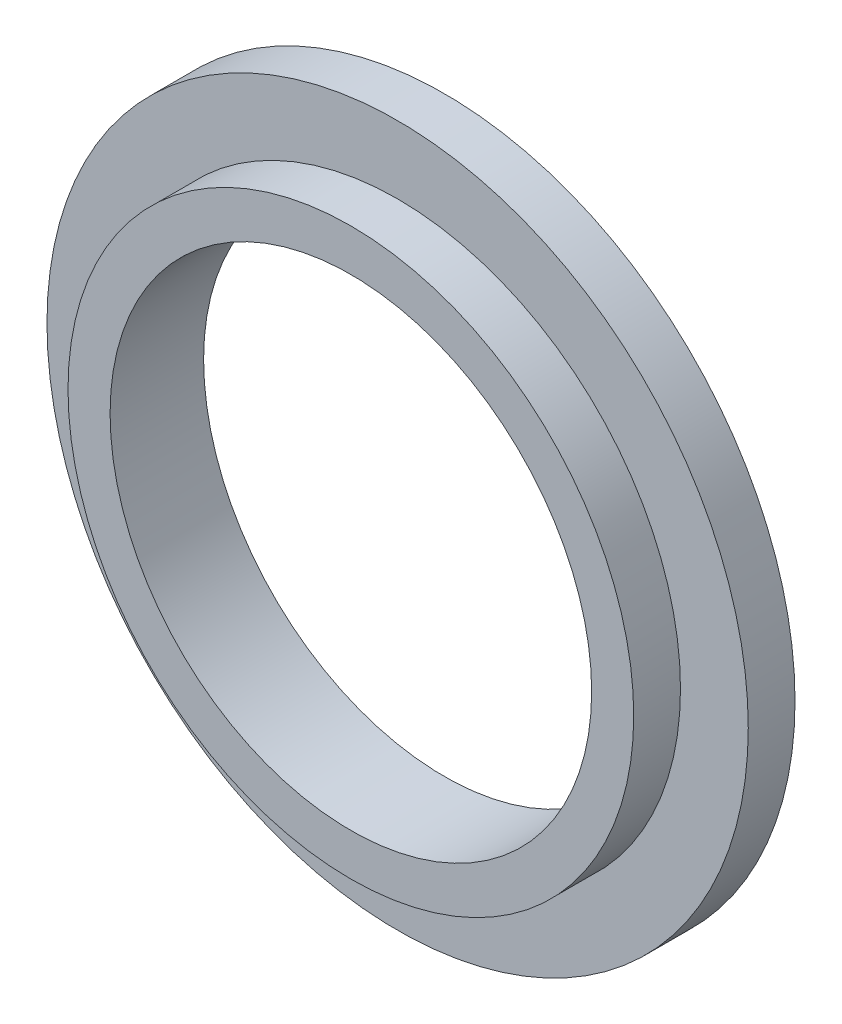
from build123d import *

# Parameters (mm, degrees)
SKETCH_1_R      = 6.05
SKETCH_1_R_2    = 5.15
EXTRUDE_1_DEPTH = 1
EXTRUDE_START   = -1
SKETCH_1_3_R    = 7.5
SKETCH_1_3_R_2  = 6.05
SKETCH_1_3_R_3  = 5.15
EXTRUDE_2_DEPTH = 1


with BuildPart() as part:
    # Sketch 1 → Extrude 1 (new body)
    with BuildSketch(Plane.XY):
        with Locations((-30.625238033, 42.404175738)):
            Circle(SKETCH_1_R)
        with Locations((-30.625238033, 42.404175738)):
            Circle(SKETCH_1_R_2, mode=Mode.SUBTRACT)
    extrude(amount=EXTRUDE_1_DEPTH)

    # Sketch 1_3 → Extrude 2 (add)
    # profile 1 of 2: a face of its own
    with BuildSketch(Plane.XY.offset(EXTRUDE_START)):
        with Locations((-30.625238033, 42.404175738)):
            Circle(SKETCH_1_3_R)
        with Locations((-30.625238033, 42.404175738)):
            Circle(SKETCH_1_3_R_2, mode=Mode.SUBTRACT)
    # profile 2 of 2: a face of its own
    with BuildSketch(Plane.XY.offset(EXTRUDE_START)):
        with Locations((-30.625238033, 42.404175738)):
            Circle(SKETCH_1_3_R_2)
        with Locations((-30.625238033, 42.404175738)):
            Circle(SKETCH_1_3_R_3, mode=Mode.SUBTRACT)
    extrude(amount=EXTRUDE_2_DEPTH)


solid = part.part
